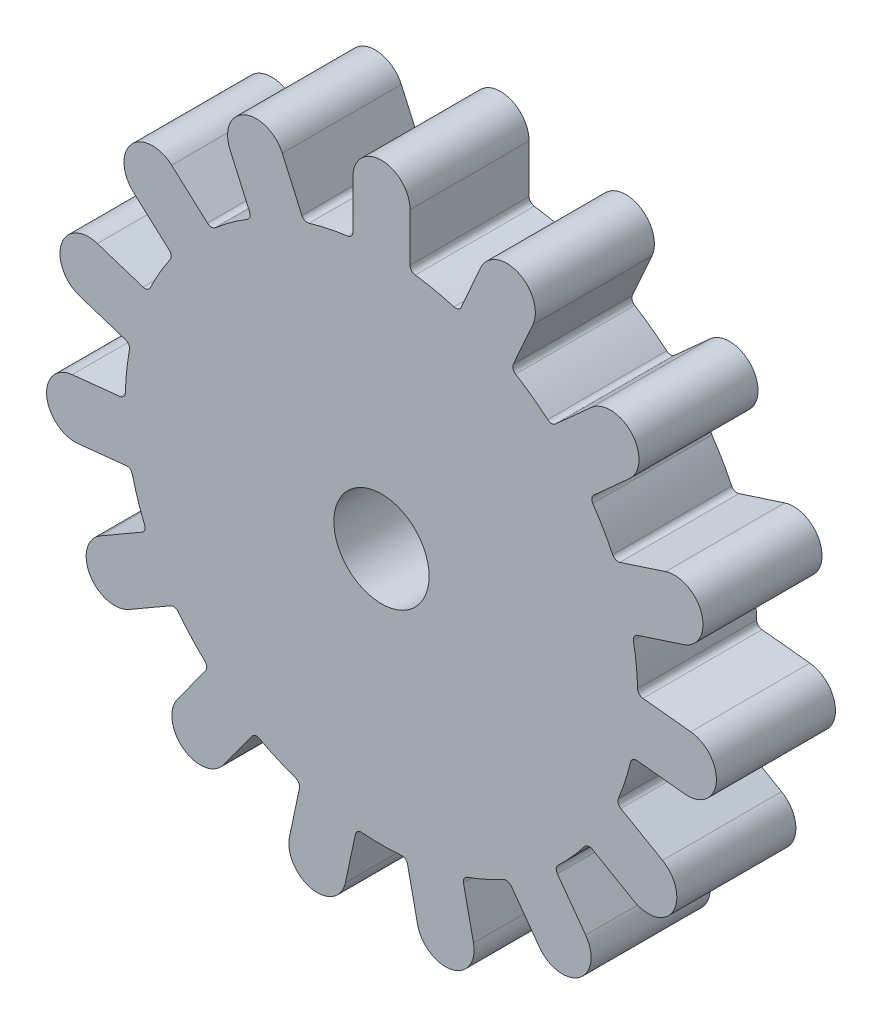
from build123d import *

# Parameters (mm, degrees)
SKETCH1_R           = 4
BOSS_EXTRUDE1_DEPTH = 10


with BuildPart() as part:
    # Sketch1 → Boss-Extrude1 (new body)
    with BuildSketch(Plane.XY):
        with BuildLine():
            Line((-2.4, 25.875), (-2.4, 21.833245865))
            ThreePointArc((-2.4, 21.833245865), (-2.523890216, 21.503789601), (-2.834165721, 21.337598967))
            ThreePointArc((-2.834165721, 21.337598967), (-4.475299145, 21.054627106), (-6.089644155, 20.645625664))
            ThreePointArc((-6.089644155, 20.645625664), (-6.440690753, 20.671247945), (-6.687872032, 20.921830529))
            Line((-6.687872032, 20.921830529), (-8.331801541, 24.61415666))
            ThreePointArc((-8.331801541, 24.61415666), (-11.500478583, 25.830497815), (-12.716819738, 22.661820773))
            Line((-12.716819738, 22.661820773), (-11.072890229, 18.969494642))
            ThreePointArc((-11.072890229, 18.969494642), (-11.052067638, 18.618130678), (-11.267922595, 18.340107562))
            ThreePointArc((-11.267922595, 18.340107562), (-12.652077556, 17.414090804), (-13.960499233, 16.383836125))
            ThreePointArc((-13.960499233, 16.383836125), (-14.291617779, 16.264459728), (-14.619350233, 16.392840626))
            Line((-14.619350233, 16.392840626), (-17.622958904, 19.097302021))
            ThreePointArc((-17.622958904, 19.097302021), (-21.01241994, 18.919667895), (-20.834785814, 15.530206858))
            Line((-20.834785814, 15.530206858), (-17.831177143, 12.825745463))
            ThreePointArc((-17.831177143, 12.825745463), (-17.66924216, 12.51322782), (-17.753353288, 12.171444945))
            ThreePointArc((-17.753353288, 12.171444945), (-18.641196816, 10.7625), (-19.417457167, 9.289132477))
            ThreePointArc((-19.417457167, 9.289132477), (-19.671394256, 9.045398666), (-20.023009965, 9.029379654))
            Line((-20.023009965, 9.029379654), (-23.866946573, 10.278350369))
            ThreePointArc((-23.866946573, 10.278350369), (-26.891122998, 8.737455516), (-25.350228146, 5.71327909))
            Line((-25.350228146, 5.71327909), (-21.506291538, 4.464308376))
            ThreePointArc((-21.506291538, 4.464308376), (-21.231244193, 4.244674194), (-21.169067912, 3.898228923))
            ThreePointArc((-21.169067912, 3.898228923), (-21.407083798, 2.249975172), (-21.516960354, 0.588253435))
            ThreePointArc((-21.516960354, 0.588253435), (-21.649807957, 0.262306), (-21.964509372, 0.10465691))
            Line((-21.964509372, 0.10465691), (-25.984122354, -0.317821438))
            ThreePointArc((-25.984122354, -0.317821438), (-28.120106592, -2.955542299), (-25.482385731, -5.091526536))
            Line((-25.482385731, -5.091526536), (-21.462772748, -4.669048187))
            ThreePointArc((-21.462772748, -4.669048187), (-21.122171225, -4.757822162), (-20.92445838, -5.049026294))
            ThreePointArc((-20.92445838, -5.049026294), (-20.471491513, -6.651590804), (-19.895985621, -8.214339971))
            ThreePointArc((-19.895985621, -8.214339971), (-19.88477318, -8.566141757), (-20.108145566, -8.838161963))
            Line((-20.108145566, -8.838161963), (-23.608407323, -10.859039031))
            ThreePointArc((-23.608407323, -10.859039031), (-24.486868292, -14.1375), (-21.208407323, -15.015960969))
            Line((-21.208407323, -15.015960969), (-17.708145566, -12.995083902))
            ThreePointArc((-17.708145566, -12.995083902), (-17.360882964, -12.937647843), (-17.061819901, -13.123258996))
            ThreePointArc((-17.061819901, -13.123258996), (-15.996192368, -14.403036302), (-14.834814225, -15.59659937))
            ThreePointArc((-14.834814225, -15.59659937), (-14.681480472, -15.913425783), (-14.774900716, -16.252782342))
            Line((-14.774900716, -16.252782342), (-17.15058419, -19.522630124))
            ThreePointArc((-17.15058419, -19.522630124), (-16.619628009, -22.874955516), (-13.267302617, -22.343999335))
            Line((-13.267302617, -22.343999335), (-10.891619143, -19.074151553))
            ThreePointArc((-10.891619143, -19.074151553), (-10.597740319, -18.880436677), (-10.249037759, -18.928360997))
            ThreePointArc((-10.249037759, -18.928360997), (-8.755006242, -19.664065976), (-7.208568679, -20.282065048))
            ThreePointArc((-7.208568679, -20.282065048), (-6.939626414, -20.509133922), (-6.886941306, -20.857149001))
            Line((-6.886941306, -20.857149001), (-7.727269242, -24.810581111))
            ThreePointArc((-7.727269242, -24.810581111), (-5.878703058, -27.657123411), (-3.032160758, -25.808557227))
            Line((-3.032160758, -25.808557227), (-2.191832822, -21.855125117))
            ThreePointArc((-2.191832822, -21.855125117), (-2.002152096, -21.558626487), (-1.664103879, -21.460577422))
            ThreePointArc((-1.664103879, -21.460577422), (0, -21.525), (1.664103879, -21.460577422))
            ThreePointArc((1.664103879, -21.460577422), (2.002152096, -21.558626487), (2.191832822, -21.855125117))
            Line((2.191832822, -21.855125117), (3.032160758, -25.808557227))
            ThreePointArc((3.032160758, -25.808557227), (5.878703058, -27.657123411), (7.727269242, -24.810581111))
            Line((7.727269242, -24.810581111), (6.886941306, -20.857149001))
            ThreePointArc((6.886941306, -20.857149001), (6.939626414, -20.509133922), (7.208568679, -20.282065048))
            ThreePointArc((7.208568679, -20.282065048), (8.755006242, -19.664065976), (10.249037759, -18.928360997))
            ThreePointArc((10.249037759, -18.928360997), (10.597740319, -18.880436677), (10.891619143, -19.074151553))
            Line((10.891619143, -19.074151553), (13.267302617, -22.343999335))
            ThreePointArc((13.267302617, -22.343999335), (16.619628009, -22.874955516), (17.15058419, -19.522630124))
            Line((17.15058419, -19.522630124), (14.774900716, -16.252782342))
            ThreePointArc((14.774900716, -16.252782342), (14.681480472, -15.913425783), (14.834814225, -15.59659937))
            ThreePointArc((14.834814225, -15.59659937), (15.996192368, -14.403036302), (17.061819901, -13.123258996))
            ThreePointArc((17.061819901, -13.123258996), (17.360882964, -12.937647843), (17.708145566, -12.995083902))
            Line((17.708145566, -12.995083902), (21.208407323, -15.015960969))
            ThreePointArc((21.208407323, -15.015960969), (24.486868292, -14.1375), (23.608407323, -10.859039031))
            Line((23.608407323, -10.859039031), (20.108145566, -8.838161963))
            ThreePointArc((20.108145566, -8.838161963), (19.88477318, -8.566141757), (19.895985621, -8.214339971))
            ThreePointArc((19.895985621, -8.214339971), (20.471491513, -6.651590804), (20.92445838, -5.049026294))
            ThreePointArc((20.92445838, -5.049026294), (21.122171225, -4.757822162), (21.462772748, -4.669048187))
            Line((21.462772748, -4.669048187), (25.482385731, -5.091526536))
            ThreePointArc((25.482385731, -5.091526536), (28.120106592, -2.955542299), (25.984122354, -0.317821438))
            Line((25.984122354, -0.317821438), (21.964509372, 0.10465691))
            ThreePointArc((21.964509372, 0.10465691), (21.649807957, 0.262306), (21.516960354, 0.588253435))
            ThreePointArc((21.516960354, 0.588253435), (21.407083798, 2.249975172), (21.169067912, 3.898228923))
            ThreePointArc((21.169067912, 3.898228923), (21.231244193, 4.244674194), (21.506291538, 4.464308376))
            Line((21.506291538, 4.464308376), (25.350228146, 5.71327909))
            ThreePointArc((25.350228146, 5.71327909), (26.891122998, 8.737455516), (23.866946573, 10.278350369))
            Line((23.866946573, 10.278350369), (20.023009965, 9.029379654))
            ThreePointArc((20.023009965, 9.029379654), (19.671394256, 9.045398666), (19.417457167, 9.289132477))
            ThreePointArc((19.417457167, 9.289132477), (18.641196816, 10.7625), (17.753353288, 12.171444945))
            ThreePointArc((17.753353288, 12.171444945), (17.66924216, 12.51322782), (17.831177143, 12.825745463))
            Line((17.831177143, 12.825745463), (20.834785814, 15.530206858))
            ThreePointArc((20.834785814, 15.530206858), (21.01241994, 18.919667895), (17.622958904, 19.097302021))
            Line((17.622958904, 19.097302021), (14.619350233, 16.392840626))
            ThreePointArc((14.619350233, 16.392840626), (14.291617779, 16.264459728), (13.960499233, 16.383836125))
            ThreePointArc((13.960499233, 16.383836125), (12.652077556, 17.414090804), (11.267922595, 18.340107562))
            ThreePointArc((11.267922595, 18.340107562), (11.052067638, 18.618130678), (11.072890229, 18.969494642))
            Line((11.072890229, 18.969494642), (12.716819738, 22.661820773))
            ThreePointArc((12.716819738, 22.661820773), (11.500478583, 25.830497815), (8.331801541, 24.61415666))
            Line((8.331801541, 24.61415666), (6.687872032, 20.921830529))
            ThreePointArc((6.687872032, 20.921830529), (6.440690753, 20.671247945), (6.089644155, 20.645625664))
            ThreePointArc((6.089644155, 20.645625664), (4.475299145, 21.054627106), (2.834165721, 21.337598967))
            ThreePointArc((2.834165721, 21.337598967), (2.523890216, 21.503789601), (2.4, 21.833245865))
            Line((2.4, 21.833245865), (2.4, 25.875))
            ThreePointArc((2.4, 25.875), (0, 28.275), (-2.4, 25.875))
        make_face()
        Circle(SKETCH1_R, mode=Mode.SUBTRACT)
    extrude(amount=BOSS_EXTRUDE1_DEPTH)


solid = part.part
